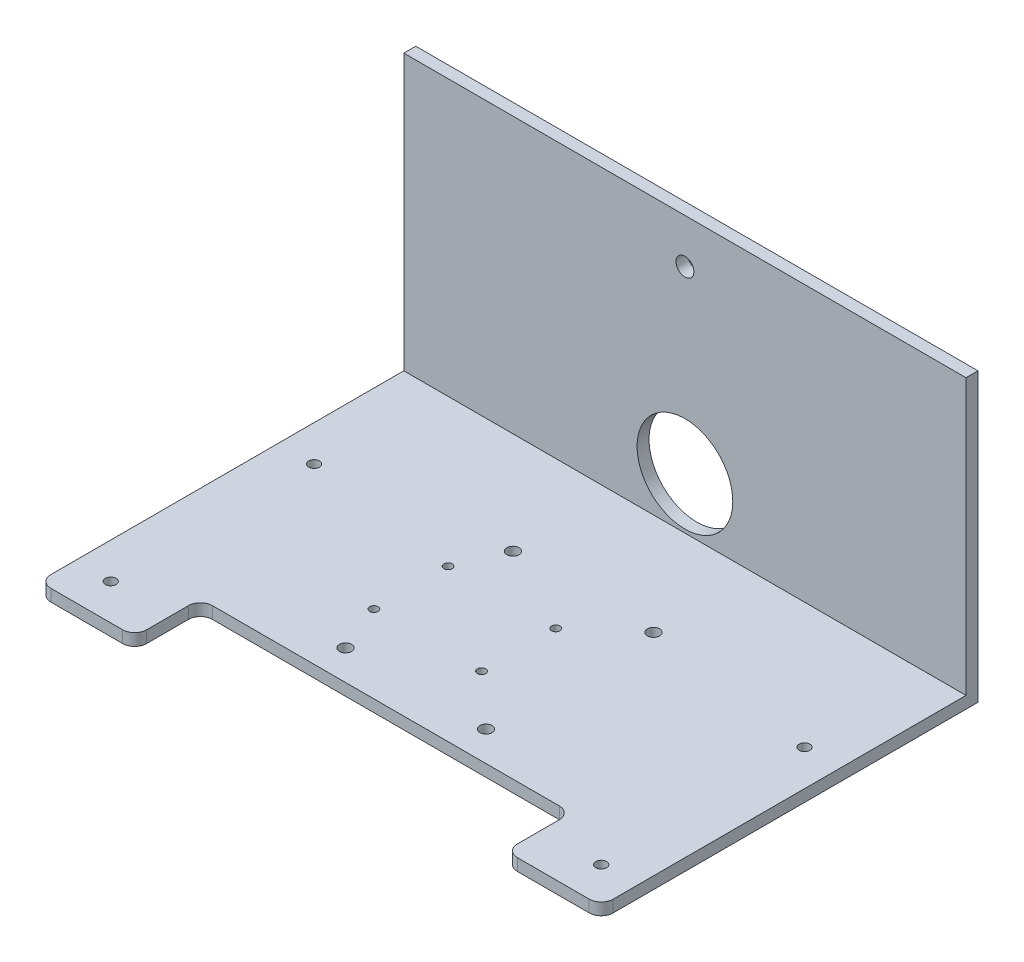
ISO-10303-21;
HEADER;
FILE_DESCRIPTION(('STEP AP214'),'2;1');
FILE_NAME('part.step','',(''),(''),'','','');
FILE_SCHEMA(('AUTOMOTIVE_DESIGN { 1 0 10303 214 1 1 1 1 }'));
ENDSEC;
DATA;
#1=APPLICATION_CONTEXT('core data for automotive mechanical design processes');
#2=APPLICATION_PROTOCOL_DEFINITION('international standard','automotive_design',2000,#1);
#3=PRODUCT_CONTEXT('',#1,'mechanical');
#4=PRODUCT('Part','Part','',(#3));
#5=PRODUCT_RELATED_PRODUCT_CATEGORY('part','',(#4));
#6=PRODUCT_DEFINITION_FORMATION('','',#4);
#7=PRODUCT_DEFINITION_CONTEXT('part definition',#1,'design');
#8=PRODUCT_DEFINITION('design','',#6,#7);
#9=PRODUCT_DEFINITION_SHAPE('','',#8);
#10=(LENGTH_UNIT() NAMED_UNIT(*) SI_UNIT(.MILLI.,.METRE.));
#11=(NAMED_UNIT(*) PLANE_ANGLE_UNIT() SI_UNIT($,.RADIAN.));
#12=(NAMED_UNIT(*) SI_UNIT($,.STERADIAN.) SOLID_ANGLE_UNIT());
#13=UNCERTAINTY_MEASURE_WITH_UNIT(LENGTH_MEASURE(1.E-05),#10,'distance_accuracy_value','');
#14=(GEOMETRIC_REPRESENTATION_CONTEXT(3) GLOBAL_UNCERTAINTY_ASSIGNED_CONTEXT((#13)) GLOBAL_UNIT_ASSIGNED_CONTEXT((#10,
#11,#12)) REPRESENTATION_CONTEXT('',''));
#15=CARTESIAN_POINT('',(0.,0.,0.));
#16=DIRECTION('',(0.,0.,1.));
#17=DIRECTION('',(1.,0.,0.));
#18=AXIS2_PLACEMENT_3D('',#15,#16,#17);
#19=CARTESIAN_POINT('',(145.,10.,-45.));
#20=DIRECTION('',(0.,1.,0.));
#21=DIRECTION('',(0.,0.,1.));
#22=AXIS2_PLACEMENT_3D('',#19,#20,#21);
#23=PLANE('',#22);
#24=DIRECTION('',(1.,0.,0.));
#25=VECTOR('',#24,1.);
#26=CARTESIAN_POINT('',(-235.,10.,-305.));
#27=LINE('',#26,#25);
#28=CARTESIAN_POINT('',(-235.,10.,-305.));
#29=VERTEX_POINT('',#28);
#30=CARTESIAN_POINT('',(235.,10.,-305.));
#31=VERTEX_POINT('',#30);
#32=EDGE_CURVE('E48',#29,#31,#27,.T.);
#33=ORIENTED_EDGE('',*,*,#32,.F.);
#34=DIRECTION('',(0.,0.,1.));
#35=VECTOR('',#34,1.);
#36=CARTESIAN_POINT('',(-235.,10.,-10.0000000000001));
#37=LINE('',#36,#35);
#38=CARTESIAN_POINT('',(-235.,10.,-10.0000000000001));
#39=VERTEX_POINT('',#38);
#40=EDGE_CURVE('E252',#29,#39,#37,.T.);
#41=ORIENTED_EDGE('',*,*,#40,.T.);
#42=CARTESIAN_POINT('',(-225.,10.,-10.));
#43=DIRECTION('',(0.,1.,0.));
#44=DIRECTION('',(0.,0.,1.));
#45=AXIS2_PLACEMENT_3D('',#42,#43,#44);
#46=CIRCLE('',#45,10.);
#47=CARTESIAN_POINT('',(-225.,10.,0.));
#48=VERTEX_POINT('',#47);
#49=EDGE_CURVE('E258',#39,#48,#46,.T.);
#50=ORIENTED_EDGE('',*,*,#49,.T.);
#51=DIRECTION('',(1.,0.,0.));
#52=VECTOR('',#51,1.);
#53=CARTESIAN_POINT('',(-165.,10.,0.));
#54=LINE('',#53,#52);
#55=CARTESIAN_POINT('',(-165.,10.,0.));
#56=VERTEX_POINT('',#55);
#57=EDGE_CURVE('E260',#48,#56,#54,.T.);
#58=ORIENTED_EDGE('',*,*,#57,.T.);
#59=CARTESIAN_POINT('',(-165.,10.,-10.));
#60=DIRECTION('',(0.,1.,0.));
#61=DIRECTION('',(0.,0.,1.));
#62=AXIS2_PLACEMENT_3D('',#59,#60,#61);
#63=CIRCLE('',#62,10.);
#64=CARTESIAN_POINT('',(-155.,10.,-10.0000000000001));
#65=VERTEX_POINT('',#64);
#66=EDGE_CURVE('E149',#56,#65,#63,.T.);
#67=ORIENTED_EDGE('',*,*,#66,.T.);
#68=DIRECTION('',(0.,0.,-1.));
#69=VECTOR('',#68,1.);
#70=CARTESIAN_POINT('',(-155.,10.,-45.));
#71=LINE('',#70,#69);
#72=CARTESIAN_POINT('',(-155.,10.,-45.));
#73=VERTEX_POINT('',#72);
#74=EDGE_CURVE('E142',#65,#73,#71,.T.);
#75=ORIENTED_EDGE('',*,*,#74,.T.);
#76=CARTESIAN_POINT('',(-145.,10.,-45.));
#77=DIRECTION('',(0.,-1.,0.));
#78=DIRECTION('',(0.,0.,-1.));
#79=AXIS2_PLACEMENT_3D('',#76,#77,#78);
#80=CIRCLE('',#79,10.);
#81=CARTESIAN_POINT('',(-145.,10.,-55.));
#82=VERTEX_POINT('',#81);
#83=EDGE_CURVE('E146',#73,#82,#80,.T.);
#84=ORIENTED_EDGE('',*,*,#83,.T.);
#85=DIRECTION('',(1.,0.,0.));
#86=VECTOR('',#85,1.);
#87=CARTESIAN_POINT('',(-145.,10.,-55.));
#88=LINE('',#87,#86);
#89=CARTESIAN_POINT('',(145.,10.,-55.));
#90=VERTEX_POINT('',#89);
#91=EDGE_CURVE('E56',#82,#90,#88,.T.);
#92=ORIENTED_EDGE('',*,*,#91,.T.);
#93=CARTESIAN_POINT('',(145.,10.,-45.));
#94=DIRECTION('',(0.,-1.,0.));
#95=DIRECTION('',(0.,0.,1.));
#96=AXIS2_PLACEMENT_3D('',#93,#94,#95);
#97=CIRCLE('',#96,10.);
#98=CARTESIAN_POINT('',(155.,10.,-45.));
#99=VERTEX_POINT('',#98);
#100=EDGE_CURVE('E198',#90,#99,#97,.T.);
#101=ORIENTED_EDGE('',*,*,#100,.T.);
#102=DIRECTION('',(0.,0.,1.));
#103=VECTOR('',#102,1.);
#104=CARTESIAN_POINT('',(155.,10.,-45.));
#105=LINE('',#104,#103);
#106=CARTESIAN_POINT('',(155.,10.,-10.0000000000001));
#107=VERTEX_POINT('',#106);
#108=EDGE_CURVE('E115',#99,#107,#105,.T.);
#109=ORIENTED_EDGE('',*,*,#108,.T.);
#110=CARTESIAN_POINT('',(165.,10.,-10.));
#111=DIRECTION('',(0.,1.,0.));
#112=DIRECTION('',(0.,0.,-1.));
#113=AXIS2_PLACEMENT_3D('',#110,#111,#112);
#114=CIRCLE('',#113,10.);
#115=CARTESIAN_POINT('',(165.,10.,0.));
#116=VERTEX_POINT('',#115);
#117=EDGE_CURVE('E231',#107,#116,#114,.T.);
#118=ORIENTED_EDGE('',*,*,#117,.T.);
#119=DIRECTION('',(1.,0.,0.));
#120=VECTOR('',#119,1.);
#121=CARTESIAN_POINT('',(165.,10.,0.));
#122=LINE('',#121,#120);
#123=CARTESIAN_POINT('',(225.,10.,0.));
#124=VERTEX_POINT('',#123);
#125=EDGE_CURVE('E250',#116,#124,#122,.T.);
#126=ORIENTED_EDGE('',*,*,#125,.T.);
#127=CARTESIAN_POINT('',(225.,10.,-10.));
#128=DIRECTION('',(0.,1.,0.));
#129=DIRECTION('',(0.,0.,-1.));
#130=AXIS2_PLACEMENT_3D('',#127,#128,#129);
#131=CIRCLE('',#130,10.);
#132=CARTESIAN_POINT('',(235.,10.,-10.0000000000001));
#133=VERTEX_POINT('',#132);
#134=EDGE_CURVE('E247',#124,#133,#131,.T.);
#135=ORIENTED_EDGE('',*,*,#134,.T.);
#136=DIRECTION('',(0.,0.,-1.));
#137=VECTOR('',#136,1.);
#138=CARTESIAN_POINT('',(235.,10.,-10.0000000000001));
#139=LINE('',#138,#137);
#140=EDGE_CURVE('E249',#133,#31,#139,.T.);
#141=ORIENTED_EDGE('',*,*,#140,.T.);
#142=EDGE_LOOP('',(#33,#41,#50,#58,#67,#75,#84,#92,#101,#109,#118,#126,#135,#141));
#143=FACE_BOUND('',#142,.T.);
#144=CARTESIAN_POINT('',(58.75,10.,-80.));
#145=DIRECTION('',(0.,1.,0.));
#146=DIRECTION('',(0.,0.,1.));
#147=AXIS2_PLACEMENT_3D('',#144,#145,#146);
#148=CIRCLE('',#147,5.12500000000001);
#149=CARTESIAN_POINT('',(58.75,10.,-74.875));
#150=VERTEX_POINT('',#149);
#151=EDGE_CURVE('E345',#150,#150,#148,.T.);
#152=ORIENTED_EDGE('',*,*,#151,.F.);
#153=EDGE_LOOP('',(#152));
#154=FACE_BOUND('',#153,.T.);
#155=CARTESIAN_POINT('',(-58.75,10.,-220.));
#156=DIRECTION('',(0.,1.,0.));
#157=DIRECTION('',(0.,0.,1.));
#158=AXIS2_PLACEMENT_3D('',#155,#156,#157);
#159=CIRCLE('',#158,5.12500000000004);
#160=CARTESIAN_POINT('',(-58.75,10.,-214.875));
#161=VERTEX_POINT('',#160);
#162=EDGE_CURVE('E339',#161,#161,#159,.T.);
#163=ORIENTED_EDGE('',*,*,#162,.F.);
#164=EDGE_LOOP('',(#163));
#165=FACE_BOUND('',#164,.T.);
#166=CARTESIAN_POINT('',(58.75,10.,-220.));
#167=DIRECTION('',(0.,1.,0.));
#168=DIRECTION('',(0.,0.,1.));
#169=AXIS2_PLACEMENT_3D('',#166,#167,#168);
#170=CIRCLE('',#169,5.12499999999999);
#171=CARTESIAN_POINT('',(58.75,10.,-214.875));
#172=VERTEX_POINT('',#171);
#173=EDGE_CURVE('E332',#172,#172,#170,.T.);
#174=ORIENTED_EDGE('',*,*,#173,.F.);
#175=EDGE_LOOP('',(#174));
#176=FACE_BOUND('',#175,.T.);
#177=CARTESIAN_POINT('',(-58.75,10.,-80.));
#178=DIRECTION('',(0.,1.,0.));
#179=DIRECTION('',(0.,0.,1.));
#180=AXIS2_PLACEMENT_3D('',#177,#178,#179);
#181=CIRCLE('',#180,5.12500000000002);
#182=CARTESIAN_POINT('',(-58.75,10.,-74.875));
#183=VERTEX_POINT('',#182);
#184=EDGE_CURVE('E326',#183,#183,#181,.T.);
#185=ORIENTED_EDGE('',*,*,#184,.F.);
#186=EDGE_LOOP('',(#185));
#187=FACE_BOUND('',#186,.T.);
#188=CARTESIAN_POINT('',(15.,10.,-182.));
#189=DIRECTION('',(0.,1.,0.));
#190=DIRECTION('',(0.,0.,1.));
#191=AXIS2_PLACEMENT_3D('',#188,#189,#190);
#192=CIRCLE('',#191,3.5);
#193=CARTESIAN_POINT('',(15.,10.,-178.5));
#194=VERTEX_POINT('',#193);
#195=EDGE_CURVE('E311',#194,#194,#192,.T.);
#196=ORIENTED_EDGE('',*,*,#195,.F.);
#197=EDGE_LOOP('',(#196));
#198=FACE_BOUND('',#197,.T.);
#199=CARTESIAN_POINT('',(-75.,10.,-182.));
#200=DIRECTION('',(0.,1.,0.));
#201=DIRECTION('',(0.,0.,1.));
#202=AXIS2_PLACEMENT_3D('',#199,#200,#201);
#203=CIRCLE('',#202,3.50000000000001);
#204=CARTESIAN_POINT('',(-75.,10.,-178.5));
#205=VERTEX_POINT('',#204);
#206=EDGE_CURVE('E299',#205,#205,#203,.T.);
#207=ORIENTED_EDGE('',*,*,#206,.F.);
#208=EDGE_LOOP('',(#207));
#209=FACE_BOUND('',#208,.T.);
#210=CARTESIAN_POINT('',(-205.,10.,-30.));
#211=DIRECTION('',(0.,1.,0.));
#212=DIRECTION('',(0.,0.,-1.));
#213=AXIS2_PLACEMENT_3D('',#210,#211,#212);
#214=CIRCLE('',#213,4.49999999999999);
#215=CARTESIAN_POINT('',(-205.,10.,-34.5));
#216=VERTEX_POINT('',#215);
#217=EDGE_CURVE('E287',#216,#216,#214,.T.);
#218=ORIENTED_EDGE('',*,*,#217,.F.);
#219=EDGE_LOOP('',(#218));
#220=FACE_BOUND('',#219,.T.);
#221=CARTESIAN_POINT('',(205.,10.,-200.));
#222=DIRECTION('',(0.,1.,0.));
#223=DIRECTION('',(0.,0.,1.));
#224=AXIS2_PLACEMENT_3D('',#221,#222,#223);
#225=CIRCLE('',#224,4.49999999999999);
#226=CARTESIAN_POINT('',(205.,10.,-195.5));
#227=VERTEX_POINT('',#226);
#228=EDGE_CURVE('E174',#227,#227,#225,.T.);
#229=ORIENTED_EDGE('',*,*,#228,.F.);
#230=EDGE_LOOP('',(#229));
#231=FACE_BOUND('',#230,.T.);
#232=CARTESIAN_POINT('',(205.,10.,-30.));
#233=DIRECTION('',(0.,1.,0.));
#234=DIRECTION('',(0.,0.,1.));
#235=AXIS2_PLACEMENT_3D('',#232,#233,#234);
#236=CIRCLE('',#235,4.49999999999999);
#237=CARTESIAN_POINT('',(205.,10.,-25.5));
#238=VERTEX_POINT('',#237);
#239=EDGE_CURVE('E281',#238,#238,#236,.T.);
#240=ORIENTED_EDGE('',*,*,#239,.F.);
#241=EDGE_LOOP('',(#240));
#242=FACE_BOUND('',#241,.T.);
#243=CARTESIAN_POINT('',(-205.,10.,-200.));
#244=DIRECTION('',(0.,1.,0.));
#245=DIRECTION('',(0.,0.,-1.));
#246=AXIS2_PLACEMENT_3D('',#243,#244,#245);
#247=CIRCLE('',#246,4.49999999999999);
#248=CARTESIAN_POINT('',(-205.,10.,-204.5));
#249=VERTEX_POINT('',#248);
#250=EDGE_CURVE('E293',#249,#249,#247,.T.);
#251=ORIENTED_EDGE('',*,*,#250,.F.);
#252=EDGE_LOOP('',(#251));
#253=FACE_BOUND('',#252,.T.);
#254=CARTESIAN_POINT('',(-75.,10.,-120.));
#255=DIRECTION('',(0.,1.,0.));
#256=DIRECTION('',(0.,0.,1.));
#257=AXIS2_PLACEMENT_3D('',#254,#255,#256);
#258=CIRCLE('',#257,3.50000000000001);
#259=CARTESIAN_POINT('',(-75.,10.,-116.5));
#260=VERTEX_POINT('',#259);
#261=EDGE_CURVE('E305',#260,#260,#258,.T.);
#262=ORIENTED_EDGE('',*,*,#261,.F.);
#263=EDGE_LOOP('',(#262));
#264=FACE_BOUND('',#263,.T.);
#265=CARTESIAN_POINT('',(15.,10.,-120.));
#266=DIRECTION('',(0.,1.,0.));
#267=DIRECTION('',(0.,0.,1.));
#268=AXIS2_PLACEMENT_3D('',#265,#266,#267);
#269=CIRCLE('',#268,3.5);
#270=CARTESIAN_POINT('',(15.,10.,-116.5));
#271=VERTEX_POINT('',#270);
#272=EDGE_CURVE('E317',#271,#271,#269,.T.);
#273=ORIENTED_EDGE('',*,*,#272,.F.);
#274=EDGE_LOOP('',(#273));
#275=FACE_BOUND('',#274,.T.);
#276=ADVANCED_FACE('F33',(#143,#154,#165,#176,#187,#198,#209,#220,#231,#242,#253,#264,#275),#23,.T.);
#277=CARTESIAN_POINT('',(145.,0.,-45.));
#278=DIRECTION('',(0.,1.,0.));
#279=DIRECTION('',(0.,0.,1.));
#280=AXIS2_PLACEMENT_3D('',#277,#278,#279);
#281=PLANE('',#280);
#282=CARTESIAN_POINT('',(58.75,0.,-80.));
#283=DIRECTION('',(0.,1.,0.));
#284=DIRECTION('',(0.,0.,1.));
#285=AXIS2_PLACEMENT_3D('',#282,#283,#284);
#286=CIRCLE('',#285,5.12500000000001);
#287=CARTESIAN_POINT('',(58.75,0.,-74.875));
#288=VERTEX_POINT('',#287);
#289=EDGE_CURVE('E329',#288,#288,#286,.T.);
#290=ORIENTED_EDGE('',*,*,#289,.T.);
#291=EDGE_LOOP('',(#290));
#292=FACE_BOUND('',#291,.T.);
#293=CARTESIAN_POINT('',(-58.75,0.,-220.));
#294=DIRECTION('',(0.,1.,0.));
#295=DIRECTION('',(0.,0.,1.));
#296=AXIS2_PLACEMENT_3D('',#293,#294,#295);
#297=CIRCLE('',#296,5.12500000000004);
#298=CARTESIAN_POINT('',(-58.75,0.,-214.875));
#299=VERTEX_POINT('',#298);
#300=EDGE_CURVE('E342',#299,#299,#297,.T.);
#301=ORIENTED_EDGE('',*,*,#300,.T.);
#302=EDGE_LOOP('',(#301));
#303=FACE_BOUND('',#302,.T.);
#304=CARTESIAN_POINT('',(58.75,0.,-220.));
#305=DIRECTION('',(0.,1.,0.));
#306=DIRECTION('',(0.,0.,1.));
#307=AXIS2_PLACEMENT_3D('',#304,#305,#306);
#308=CIRCLE('',#307,5.12499999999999);
#309=CARTESIAN_POINT('',(58.75,0.,-214.875));
#310=VERTEX_POINT('',#309);
#311=EDGE_CURVE('E335',#310,#310,#308,.T.);
#312=ORIENTED_EDGE('',*,*,#311,.T.);
#313=EDGE_LOOP('',(#312));
#314=FACE_BOUND('',#313,.T.);
#315=CARTESIAN_POINT('',(-58.75,0.,-80.));
#316=DIRECTION('',(0.,1.,0.));
#317=DIRECTION('',(0.,0.,1.));
#318=AXIS2_PLACEMENT_3D('',#315,#316,#317);
#319=CIRCLE('',#318,5.12500000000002);
#320=CARTESIAN_POINT('',(-58.75,0.,-74.875));
#321=VERTEX_POINT('',#320);
#322=EDGE_CURVE('E323',#321,#321,#319,.T.);
#323=ORIENTED_EDGE('',*,*,#322,.T.);
#324=EDGE_LOOP('',(#323));
#325=FACE_BOUND('',#324,.T.);
#326=CARTESIAN_POINT('',(145.,0.,-45.));
#327=DIRECTION('',(0.,-1.,0.));
#328=DIRECTION('',(0.,0.,1.));
#329=AXIS2_PLACEMENT_3D('',#326,#327,#328);
#330=CIRCLE('',#329,10.);
#331=CARTESIAN_POINT('',(145.,0.,-55.));
#332=VERTEX_POINT('',#331);
#333=CARTESIAN_POINT('',(155.,0.,-45.));
#334=VERTEX_POINT('',#333);
#335=EDGE_CURVE('E170',#332,#334,#330,.T.);
#336=ORIENTED_EDGE('',*,*,#335,.F.);
#337=DIRECTION('',(1.,0.,0.));
#338=VECTOR('',#337,1.);
#339=CARTESIAN_POINT('',(-145.,0.,-55.));
#340=LINE('',#339,#338);
#341=CARTESIAN_POINT('',(-145.,0.,-55.));
#342=VERTEX_POINT('',#341);
#343=EDGE_CURVE('E107',#342,#332,#340,.T.);
#344=ORIENTED_EDGE('',*,*,#343,.F.);
#345=CARTESIAN_POINT('',(-145.,0.,-45.));
#346=DIRECTION('',(0.,-1.,0.));
#347=DIRECTION('',(0.,0.,-1.));
#348=AXIS2_PLACEMENT_3D('',#345,#346,#347);
#349=CIRCLE('',#348,10.);
#350=CARTESIAN_POINT('',(-155.,0.,-45.));
#351=VERTEX_POINT('',#350);
#352=EDGE_CURVE('E195',#351,#342,#349,.T.);
#353=ORIENTED_EDGE('',*,*,#352,.F.);
#354=DIRECTION('',(0.,0.,-1.));
#355=VECTOR('',#354,1.);
#356=CARTESIAN_POINT('',(-155.,0.,-45.));
#357=LINE('',#356,#355);
#358=CARTESIAN_POINT('',(-155.,0.,-10.0000000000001));
#359=VERTEX_POINT('',#358);
#360=EDGE_CURVE('E158',#359,#351,#357,.T.);
#361=ORIENTED_EDGE('',*,*,#360,.F.);
#362=CARTESIAN_POINT('',(-165.,0.,-10.));
#363=DIRECTION('',(0.,1.,0.));
#364=DIRECTION('',(0.,0.,1.));
#365=AXIS2_PLACEMENT_3D('',#362,#363,#364);
#366=CIRCLE('',#365,10.);
#367=CARTESIAN_POINT('',(-165.,0.,0.));
#368=VERTEX_POINT('',#367);
#369=EDGE_CURVE('E192',#368,#359,#366,.T.);
#370=ORIENTED_EDGE('',*,*,#369,.F.);
#371=DIRECTION('',(1.,0.,0.));
#372=VECTOR('',#371,1.);
#373=CARTESIAN_POINT('',(-165.,0.,0.));
#374=LINE('',#373,#372);
#375=CARTESIAN_POINT('',(-225.,0.,0.));
#376=VERTEX_POINT('',#375);
#377=EDGE_CURVE('E190',#376,#368,#374,.T.);
#378=ORIENTED_EDGE('',*,*,#377,.F.);
#379=CARTESIAN_POINT('',(-225.,0.,-10.));
#380=DIRECTION('',(0.,1.,0.));
#381=DIRECTION('',(0.,0.,1.));
#382=AXIS2_PLACEMENT_3D('',#379,#380,#381);
#383=CIRCLE('',#382,10.);
#384=CARTESIAN_POINT('',(-235.,0.,-10.0000000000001));
#385=VERTEX_POINT('',#384);
#386=EDGE_CURVE('E188',#385,#376,#383,.T.);
#387=ORIENTED_EDGE('',*,*,#386,.F.);
#388=DIRECTION('',(0.,0.,1.));
#389=VECTOR('',#388,1.);
#390=CARTESIAN_POINT('',(-235.,0.,-10.0000000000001));
#391=LINE('',#390,#389);
#392=CARTESIAN_POINT('',(-235.,0.,-315.));
#393=VERTEX_POINT('',#392);
#394=EDGE_CURVE('E186',#393,#385,#391,.T.);
#395=ORIENTED_EDGE('',*,*,#394,.F.);
#396=DIRECTION('',(-1.,0.,0.));
#397=VECTOR('',#396,1.);
#398=CARTESIAN_POINT('',(-235.,0.,-315.));
#399=LINE('',#398,#397);
#400=CARTESIAN_POINT('',(235.,0.,-315.));
#401=VERTEX_POINT('',#400);
#402=EDGE_CURVE('E184',#401,#393,#399,.T.);
#403=ORIENTED_EDGE('',*,*,#402,.F.);
#404=DIRECTION('',(0.,0.,-1.));
#405=VECTOR('',#404,1.);
#406=CARTESIAN_POINT('',(235.,0.,-10.0000000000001));
#407=LINE('',#406,#405);
#408=CARTESIAN_POINT('',(235.,0.,-10.0000000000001));
#409=VERTEX_POINT('',#408);
#410=EDGE_CURVE('E182',#409,#401,#407,.T.);
#411=ORIENTED_EDGE('',*,*,#410,.F.);
#412=CARTESIAN_POINT('',(225.,0.,-10.));
#413=DIRECTION('',(0.,1.,0.));
#414=DIRECTION('',(0.,0.,-1.));
#415=AXIS2_PLACEMENT_3D('',#412,#413,#414);
#416=CIRCLE('',#415,10.);
#417=CARTESIAN_POINT('',(225.,0.,0.));
#418=VERTEX_POINT('',#417);
#419=EDGE_CURVE('E180',#418,#409,#416,.T.);
#420=ORIENTED_EDGE('',*,*,#419,.F.);
#421=DIRECTION('',(1.,0.,0.));
#422=VECTOR('',#421,1.);
#423=CARTESIAN_POINT('',(165.,0.,0.));
#424=LINE('',#423,#422);
#425=CARTESIAN_POINT('',(165.,0.,0.));
#426=VERTEX_POINT('',#425);
#427=EDGE_CURVE('E178',#426,#418,#424,.T.);
#428=ORIENTED_EDGE('',*,*,#427,.F.);
#429=CARTESIAN_POINT('',(165.,0.,-10.));
#430=DIRECTION('',(0.,1.,0.));
#431=DIRECTION('',(0.,0.,-1.));
#432=AXIS2_PLACEMENT_3D('',#429,#430,#431);
#433=CIRCLE('',#432,10.);
#434=CARTESIAN_POINT('',(155.,0.,-10.0000000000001));
#435=VERTEX_POINT('',#434);
#436=EDGE_CURVE('E176',#435,#426,#433,.T.);
#437=ORIENTED_EDGE('',*,*,#436,.F.);
#438=DIRECTION('',(0.,0.,1.));
#439=VECTOR('',#438,1.);
#440=CARTESIAN_POINT('',(155.,0.,-45.));
#441=LINE('',#440,#439);
#442=EDGE_CURVE('E173',#334,#435,#441,.T.);
#443=ORIENTED_EDGE('',*,*,#442,.F.);
#444=EDGE_LOOP('',(#336,#344,#353,#361,#370,#378,#387,#395,#403,#411,#420,#428,#437,#443));
#445=FACE_BOUND('',#444,.T.);
#446=CARTESIAN_POINT('',(205.,0.,-200.));
#447=DIRECTION('',(0.,1.,0.));
#448=DIRECTION('',(0.,0.,1.));
#449=AXIS2_PLACEMENT_3D('',#446,#447,#448);
#450=CIRCLE('',#449,4.49999999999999);
#451=CARTESIAN_POINT('',(205.,0.,-195.5));
#452=VERTEX_POINT('',#451);
#453=EDGE_CURVE('E278',#452,#452,#450,.T.);
#454=ORIENTED_EDGE('',*,*,#453,.T.);
#455=EDGE_LOOP('',(#454));
#456=FACE_BOUND('',#455,.T.);
#457=CARTESIAN_POINT('',(205.,0.,-30.));
#458=DIRECTION('',(0.,1.,0.));
#459=DIRECTION('',(0.,0.,1.));
#460=AXIS2_PLACEMENT_3D('',#457,#458,#459);
#461=CIRCLE('',#460,4.49999999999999);
#462=CARTESIAN_POINT('',(205.,0.,-25.5));
#463=VERTEX_POINT('',#462);
#464=EDGE_CURVE('E284',#463,#463,#461,.T.);
#465=ORIENTED_EDGE('',*,*,#464,.T.);
#466=EDGE_LOOP('',(#465));
#467=FACE_BOUND('',#466,.T.);
#468=CARTESIAN_POINT('',(-205.,0.,-30.));
#469=DIRECTION('',(0.,1.,0.));
#470=DIRECTION('',(0.,0.,-1.));
#471=AXIS2_PLACEMENT_3D('',#468,#469,#470);
#472=CIRCLE('',#471,4.49999999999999);
#473=CARTESIAN_POINT('',(-205.,0.,-34.5));
#474=VERTEX_POINT('',#473);
#475=EDGE_CURVE('E290',#474,#474,#472,.T.);
#476=ORIENTED_EDGE('',*,*,#475,.T.);
#477=EDGE_LOOP('',(#476));
#478=FACE_BOUND('',#477,.T.);
#479=CARTESIAN_POINT('',(-205.,0.,-200.));
#480=DIRECTION('',(0.,1.,0.));
#481=DIRECTION('',(0.,0.,-1.));
#482=AXIS2_PLACEMENT_3D('',#479,#480,#481);
#483=CIRCLE('',#482,4.49999999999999);
#484=CARTESIAN_POINT('',(-205.,0.,-204.5));
#485=VERTEX_POINT('',#484);
#486=EDGE_CURVE('E296',#485,#485,#483,.T.);
#487=ORIENTED_EDGE('',*,*,#486,.T.);
#488=EDGE_LOOP('',(#487));
#489=FACE_BOUND('',#488,.T.);
#490=CARTESIAN_POINT('',(-75.,0.,-182.));
#491=DIRECTION('',(0.,1.,0.));
#492=DIRECTION('',(0.,0.,1.));
#493=AXIS2_PLACEMENT_3D('',#490,#491,#492);
#494=CIRCLE('',#493,3.50000000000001);
#495=CARTESIAN_POINT('',(-75.,0.,-178.5));
#496=VERTEX_POINT('',#495);
#497=EDGE_CURVE('E302',#496,#496,#494,.T.);
#498=ORIENTED_EDGE('',*,*,#497,.T.);
#499=EDGE_LOOP('',(#498));
#500=FACE_BOUND('',#499,.T.);
#501=CARTESIAN_POINT('',(-75.,0.,-120.));
#502=DIRECTION('',(0.,1.,0.));
#503=DIRECTION('',(0.,0.,1.));
#504=AXIS2_PLACEMENT_3D('',#501,#502,#503);
#505=CIRCLE('',#504,3.50000000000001);
#506=CARTESIAN_POINT('',(-75.,0.,-116.5));
#507=VERTEX_POINT('',#506);
#508=EDGE_CURVE('E308',#507,#507,#505,.T.);
#509=ORIENTED_EDGE('',*,*,#508,.T.);
#510=EDGE_LOOP('',(#509));
#511=FACE_BOUND('',#510,.T.);
#512=CARTESIAN_POINT('',(15.,0.,-182.));
#513=DIRECTION('',(0.,1.,0.));
#514=DIRECTION('',(0.,0.,1.));
#515=AXIS2_PLACEMENT_3D('',#512,#513,#514);
#516=CIRCLE('',#515,3.5);
#517=CARTESIAN_POINT('',(15.,0.,-178.5));
#518=VERTEX_POINT('',#517);
#519=EDGE_CURVE('E314',#518,#518,#516,.T.);
#520=ORIENTED_EDGE('',*,*,#519,.T.);
#521=EDGE_LOOP('',(#520));
#522=FACE_BOUND('',#521,.T.);
#523=CARTESIAN_POINT('',(15.,0.,-120.));
#524=DIRECTION('',(0.,1.,0.));
#525=DIRECTION('',(0.,0.,1.));
#526=AXIS2_PLACEMENT_3D('',#523,#524,#525);
#527=CIRCLE('',#526,3.5);
#528=CARTESIAN_POINT('',(15.,0.,-116.5));
#529=VERTEX_POINT('',#528);
#530=EDGE_CURVE('E320',#529,#529,#527,.T.);
#531=ORIENTED_EDGE('',*,*,#530,.T.);
#532=EDGE_LOOP('',(#531));
#533=FACE_BOUND('',#532,.T.);
#534=ADVANCED_FACE('F235',(#292,#303,#314,#325,#445,#456,#467,#478,#489,#500,#511,#522,#533),
#281,.F.);
#535=CARTESIAN_POINT('',(145.,10.,-45.));
#536=DIRECTION('',(0.,-1.,0.));
#537=DIRECTION('',(0.,0.,-1.));
#538=AXIS2_PLACEMENT_3D('',#535,#536,#537);
#539=CYLINDRICAL_SURFACE('',#538,10.);
#540=ORIENTED_EDGE('',*,*,#335,.T.);
#541=DIRECTION('',(0.,-1.,0.));
#542=VECTOR('',#541,1.);
#543=CARTESIAN_POINT('',(155.,10.,-45.));
#544=LINE('',#543,#542);
#545=EDGE_CURVE('E11',#99,#334,#544,.T.);
#546=ORIENTED_EDGE('',*,*,#545,.F.);
#547=ORIENTED_EDGE('',*,*,#100,.F.);
#548=DIRECTION('',(0.,-1.,0.));
#549=VECTOR('',#548,1.);
#550=CARTESIAN_POINT('',(145.,10.,-55.));
#551=LINE('',#550,#549);
#552=EDGE_CURVE('E166',#90,#332,#551,.T.);
#553=ORIENTED_EDGE('',*,*,#552,.T.);
#554=EDGE_LOOP('',(#540,#546,#547,#553));
#555=FACE_BOUND('',#554,.T.);
#556=ADVANCED_FACE('F35',(#555),#539,.F.);
#557=CARTESIAN_POINT('',(155.,10.,-45.));
#558=DIRECTION('',(1.,0.,0.));
#559=DIRECTION('',(0.,0.,-1.));
#560=AXIS2_PLACEMENT_3D('',#557,#558,#559);
#561=PLANE('',#560);
#562=ORIENTED_EDGE('',*,*,#442,.T.);
#563=DIRECTION('',(0.,-1.,0.));
#564=VECTOR('',#563,1.);
#565=CARTESIAN_POINT('',(155.,10.,-10.0000000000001));
#566=LINE('',#565,#564);
#567=EDGE_CURVE('E41',#107,#435,#566,.T.);
#568=ORIENTED_EDGE('',*,*,#567,.F.);
#569=ORIENTED_EDGE('',*,*,#108,.F.);
#570=ORIENTED_EDGE('',*,*,#545,.T.);
#571=EDGE_LOOP('',(#562,#568,#569,#570));
#572=FACE_BOUND('',#571,.T.);
#573=ADVANCED_FACE('F678',(#572),#561,.F.);
#574=CARTESIAN_POINT('',(165.,10.,-10.));
#575=DIRECTION('',(0.,-1.,0.));
#576=DIRECTION('',(0.,0.,-1.));
#577=AXIS2_PLACEMENT_3D('',#574,#575,#576);
#578=CYLINDRICAL_SURFACE('',#577,10.);
#579=ORIENTED_EDGE('',*,*,#436,.T.);
#580=DIRECTION('',(0.,-1.,0.));
#581=VECTOR('',#580,1.);
#582=CARTESIAN_POINT('',(165.,10.,0.));
#583=LINE('',#582,#581);
#584=EDGE_CURVE('E223',#116,#426,#583,.T.);
#585=ORIENTED_EDGE('',*,*,#584,.F.);
#586=ORIENTED_EDGE('',*,*,#117,.F.);
#587=ORIENTED_EDGE('',*,*,#567,.T.);
#588=EDGE_LOOP('',(#579,#585,#586,#587));
#589=FACE_BOUND('',#588,.T.);
#590=ADVANCED_FACE('F229',(#589),#578,.T.);
#591=CARTESIAN_POINT('',(165.,10.,0.));
#592=DIRECTION('',(0.,0.,-1.));
#593=DIRECTION('',(-1.,0.,0.));
#594=AXIS2_PLACEMENT_3D('',#591,#592,#593);
#595=PLANE('',#594);
#596=ORIENTED_EDGE('',*,*,#427,.T.);
#597=DIRECTION('',(0.,-1.,0.));
#598=VECTOR('',#597,1.);
#599=CARTESIAN_POINT('',(225.,10.,0.));
#600=LINE('',#599,#598);
#601=EDGE_CURVE('E220',#124,#418,#600,.T.);
#602=ORIENTED_EDGE('',*,*,#601,.F.);
#603=ORIENTED_EDGE('',*,*,#125,.F.);
#604=ORIENTED_EDGE('',*,*,#584,.T.);
#605=EDGE_LOOP('',(#596,#602,#603,#604));
#606=FACE_BOUND('',#605,.T.);
#607=ADVANCED_FACE('F241',(#606),#595,.F.);
#608=CARTESIAN_POINT('',(225.,10.,-10.));
#609=DIRECTION('',(0.,-1.,0.));
#610=DIRECTION('',(0.,0.,-1.));
#611=AXIS2_PLACEMENT_3D('',#608,#609,#610);
#612=CYLINDRICAL_SURFACE('',#611,10.);
#613=ORIENTED_EDGE('',*,*,#419,.T.);
#614=DIRECTION('',(0.,-1.,0.));
#615=VECTOR('',#614,1.);
#616=CARTESIAN_POINT('',(235.,10.,-10.0000000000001));
#617=LINE('',#616,#615);
#618=EDGE_CURVE('E217',#133,#409,#617,.T.);
#619=ORIENTED_EDGE('',*,*,#618,.F.);
#620=ORIENTED_EDGE('',*,*,#134,.F.);
#621=ORIENTED_EDGE('',*,*,#601,.T.);
#622=EDGE_LOOP('',(#613,#619,#620,#621));
#623=FACE_BOUND('',#622,.T.);
#624=ADVANCED_FACE('F245',(#623),#612,.T.);
#625=CARTESIAN_POINT('',(235.,10.,-10.0000000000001));
#626=DIRECTION('',(-1.,0.,0.));
#627=DIRECTION('',(0.,0.,1.));
#628=AXIS2_PLACEMENT_3D('',#625,#626,#627);
#629=PLANE('',#628);
#630=ORIENTED_EDGE('',*,*,#410,.T.);
#631=DIRECTION('',(0.,-1.,0.));
#632=VECTOR('',#631,1.);
#633=CARTESIAN_POINT('',(235.,10.,-315.));
#634=LINE('',#633,#632);
#635=CARTESIAN_POINT('',(235.,240.,-315.));
#636=VERTEX_POINT('',#635);
#637=EDGE_CURVE('E214',#636,#401,#634,.T.);
#638=ORIENTED_EDGE('',*,*,#637,.F.);
#639=DIRECTION('',(0.,0.,-1.));
#640=VECTOR('',#639,1.);
#641=CARTESIAN_POINT('',(235.,240.,-315.));
#642=LINE('',#641,#640);
#643=CARTESIAN_POINT('',(235.,240.,-305.));
#644=VERTEX_POINT('',#643);
#645=EDGE_CURVE('E361',#644,#636,#642,.T.);
#646=ORIENTED_EDGE('',*,*,#645,.F.);
#647=DIRECTION('',(0.,-1.,0.));
#648=VECTOR('',#647,1.);
#649=CARTESIAN_POINT('',(235.,240.,-305.));
#650=LINE('',#649,#648);
#651=EDGE_CURVE('E352',#644,#31,#650,.T.);
#652=ORIENTED_EDGE('',*,*,#651,.T.);
#653=ORIENTED_EDGE('',*,*,#140,.F.);
#654=ORIENTED_EDGE('',*,*,#618,.T.);
#655=EDGE_LOOP('',(#630,#638,#646,#652,#653,#654));
#656=FACE_BOUND('',#655,.T.);
#657=ADVANCED_FACE('F399',(#656),#629,.F.);
#658=CARTESIAN_POINT('',(-235.,10.,-315.));
#659=DIRECTION('',(0.,0.,1.));
#660=DIRECTION('',(1.,0.,0.));
#661=AXIS2_PLACEMENT_3D('',#658,#659,#660);
#662=PLANE('',#661);
#663=CARTESIAN_POINT('',(0.,52.9,-315.));
#664=DIRECTION('',(0.,0.,1.));
#665=DIRECTION('',(1.,0.,0.));
#666=AXIS2_PLACEMENT_3D('',#663,#664,#665);
#667=CIRCLE('',#666,40.);
#668=CARTESIAN_POINT('',(40.,52.9,-315.));
#669=VERTEX_POINT('',#668);
#670=EDGE_CURVE('E374',#669,#669,#667,.T.);
#671=ORIENTED_EDGE('',*,*,#670,.T.);
#672=EDGE_LOOP('',(#671));
#673=FACE_BOUND('',#672,.T.);
#674=CARTESIAN_POINT('',(0.,202.9,-315.));
#675=DIRECTION('',(0.,0.,1.));
#676=DIRECTION('',(1.,0.,0.));
#677=AXIS2_PLACEMENT_3D('',#674,#675,#676);
#678=CIRCLE('',#677,7.5);
#679=CARTESIAN_POINT('',(7.5,202.9,-315.));
#680=VERTEX_POINT('',#679);
#681=EDGE_CURVE('E358',#680,#680,#678,.T.);
#682=ORIENTED_EDGE('',*,*,#681,.T.);
#683=EDGE_LOOP('',(#682));
#684=FACE_BOUND('',#683,.T.);
#685=ORIENTED_EDGE('',*,*,#402,.T.);
#686=DIRECTION('',(0.,-1.,0.));
#687=VECTOR('',#686,1.);
#688=CARTESIAN_POINT('',(-235.,10.,-315.));
#689=LINE('',#688,#687);
#690=CARTESIAN_POINT('',(-235.,240.,-315.));
#691=VERTEX_POINT('',#690);
#692=EDGE_CURVE('E211',#691,#393,#689,.T.);
#693=ORIENTED_EDGE('',*,*,#692,.F.);
#694=DIRECTION('',(-1.,0.,0.));
#695=VECTOR('',#694,1.);
#696=CARTESIAN_POINT('',(-235.,240.,-315.));
#697=LINE('',#696,#695);
#698=EDGE_CURVE('E355',#636,#691,#697,.T.);
#699=ORIENTED_EDGE('',*,*,#698,.F.);
#700=ORIENTED_EDGE('',*,*,#637,.T.);
#701=EDGE_LOOP('',(#685,#693,#699,#700));
#702=FACE_BOUND('',#701,.T.);
#703=ADVANCED_FACE('F409',(#673,#684,#702),#662,.F.);
#704=CARTESIAN_POINT('',(-235.,10.,-10.0000000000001));
#705=DIRECTION('',(1.,0.,0.));
#706=DIRECTION('',(0.,0.,-1.));
#707=AXIS2_PLACEMENT_3D('',#704,#705,#706);
#708=PLANE('',#707);
#709=ORIENTED_EDGE('',*,*,#394,.T.);
#710=DIRECTION('',(0.,-1.,0.));
#711=VECTOR('',#710,1.);
#712=CARTESIAN_POINT('',(-235.,10.,-10.0000000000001));
#713=LINE('',#712,#711);
#714=EDGE_CURVE('E208',#39,#385,#713,.T.);
#715=ORIENTED_EDGE('',*,*,#714,.F.);
#716=ORIENTED_EDGE('',*,*,#40,.F.);
#717=DIRECTION('',(0.,-1.,0.));
#718=VECTOR('',#717,1.);
#719=CARTESIAN_POINT('',(-235.,240.,-305.));
#720=LINE('',#719,#718);
#721=CARTESIAN_POINT('',(-235.,240.,-305.));
#722=VERTEX_POINT('',#721);
#723=EDGE_CURVE('E336',#722,#29,#720,.T.);
#724=ORIENTED_EDGE('',*,*,#723,.F.);
#725=DIRECTION('',(0.,0.,1.));
#726=VECTOR('',#725,1.);
#727=CARTESIAN_POINT('',(-235.,240.,-315.));
#728=LINE('',#727,#726);
#729=EDGE_CURVE('E357',#691,#722,#728,.T.);
#730=ORIENTED_EDGE('',*,*,#729,.F.);
#731=ORIENTED_EDGE('',*,*,#692,.T.);
#732=EDGE_LOOP('',(#709,#715,#716,#724,#730,#731));
#733=FACE_BOUND('',#732,.T.);
#734=ADVANCED_FACE('F413',(#733),#708,.F.);
#735=CARTESIAN_POINT('',(-225.,10.,-10.));
#736=DIRECTION('',(0.,-1.,0.));
#737=DIRECTION('',(0.,0.,-1.));
#738=AXIS2_PLACEMENT_3D('',#735,#736,#737);
#739=CYLINDRICAL_SURFACE('',#738,10.);
#740=ORIENTED_EDGE('',*,*,#386,.T.);
#741=DIRECTION('',(0.,-1.,0.));
#742=VECTOR('',#741,1.);
#743=CARTESIAN_POINT('',(-225.,10.,0.));
#744=LINE('',#743,#742);
#745=EDGE_CURVE('E205',#48,#376,#744,.T.);
#746=ORIENTED_EDGE('',*,*,#745,.F.);
#747=ORIENTED_EDGE('',*,*,#49,.F.);
#748=ORIENTED_EDGE('',*,*,#714,.T.);
#749=EDGE_LOOP('',(#740,#746,#747,#748));
#750=FACE_BOUND('',#749,.T.);
#751=ADVANCED_FACE('F417',(#750),#739,.T.);
#752=CARTESIAN_POINT('',(-165.,10.,0.));
#753=DIRECTION('',(0.,0.,-1.));
#754=DIRECTION('',(-1.,0.,0.));
#755=AXIS2_PLACEMENT_3D('',#752,#753,#754);
#756=PLANE('',#755);
#757=ORIENTED_EDGE('',*,*,#377,.T.);
#758=DIRECTION('',(0.,-1.,0.));
#759=VECTOR('',#758,1.);
#760=CARTESIAN_POINT('',(-165.,10.,0.));
#761=LINE('',#760,#759);
#762=EDGE_CURVE('E202',#56,#368,#761,.T.);
#763=ORIENTED_EDGE('',*,*,#762,.F.);
#764=ORIENTED_EDGE('',*,*,#57,.F.);
#765=ORIENTED_EDGE('',*,*,#745,.T.);
#766=EDGE_LOOP('',(#757,#763,#764,#765));
#767=FACE_BOUND('',#766,.T.);
#768=ADVANCED_FACE('F266',(#767),#756,.F.);
#769=CARTESIAN_POINT('',(-165.,10.,-10.));
#770=DIRECTION('',(0.,-1.,0.));
#771=DIRECTION('',(0.,0.,-1.));
#772=AXIS2_PLACEMENT_3D('',#769,#770,#771);
#773=CYLINDRICAL_SURFACE('',#772,10.);
#774=ORIENTED_EDGE('',*,*,#369,.T.);
#775=DIRECTION('',(0.,-1.,0.));
#776=VECTOR('',#775,1.);
#777=CARTESIAN_POINT('',(-155.,10.,-10.0000000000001));
#778=LINE('',#777,#776);
#779=EDGE_CURVE('E161',#65,#359,#778,.T.);
#780=ORIENTED_EDGE('',*,*,#779,.F.);
#781=ORIENTED_EDGE('',*,*,#66,.F.);
#782=ORIENTED_EDGE('',*,*,#762,.T.);
#783=EDGE_LOOP('',(#774,#780,#781,#782));
#784=FACE_BOUND('',#783,.T.);
#785=ADVANCED_FACE('F270',(#784),#773,.T.);
#786=CARTESIAN_POINT('',(-155.,10.,-45.));
#787=DIRECTION('',(-1.,0.,0.));
#788=DIRECTION('',(0.,0.,1.));
#789=AXIS2_PLACEMENT_3D('',#786,#787,#788);
#790=PLANE('',#789);
#791=ORIENTED_EDGE('',*,*,#360,.T.);
#792=DIRECTION('',(0.,-1.,0.));
#793=VECTOR('',#792,1.);
#794=CARTESIAN_POINT('',(-155.,10.,-45.));
#795=LINE('',#794,#793);
#796=EDGE_CURVE('E155',#73,#351,#795,.T.);
#797=ORIENTED_EDGE('',*,*,#796,.F.);
#798=ORIENTED_EDGE('',*,*,#74,.F.);
#799=ORIENTED_EDGE('',*,*,#779,.T.);
#800=EDGE_LOOP('',(#791,#797,#798,#799));
#801=FACE_BOUND('',#800,.T.);
#802=ADVANCED_FACE('F156',(#801),#790,.F.);
#803=CARTESIAN_POINT('',(-145.,10.,-45.));
#804=DIRECTION('',(0.,-1.,0.));
#805=DIRECTION('',(0.,0.,-1.));
#806=AXIS2_PLACEMENT_3D('',#803,#804,#805);
#807=CYLINDRICAL_SURFACE('',#806,10.);
#808=ORIENTED_EDGE('',*,*,#352,.T.);
#809=DIRECTION('',(0.,-1.,0.));
#810=VECTOR('',#809,1.);
#811=CARTESIAN_POINT('',(-145.,10.,-55.));
#812=LINE('',#811,#810);
#813=EDGE_CURVE('E162',#82,#342,#812,.T.);
#814=ORIENTED_EDGE('',*,*,#813,.F.);
#815=ORIENTED_EDGE('',*,*,#83,.F.);
#816=ORIENTED_EDGE('',*,*,#796,.T.);
#817=EDGE_LOOP('',(#808,#814,#815,#816));
#818=FACE_BOUND('',#817,.T.);
#819=ADVANCED_FACE('F164',(#818),#807,.F.);
#820=CARTESIAN_POINT('',(-145.,10.,-55.));
#821=DIRECTION('',(0.,0.,-1.));
#822=DIRECTION('',(-1.,0.,0.));
#823=AXIS2_PLACEMENT_3D('',#820,#821,#822);
#824=PLANE('',#823);
#825=ORIENTED_EDGE('',*,*,#343,.T.);
#826=ORIENTED_EDGE('',*,*,#552,.F.);
#827=ORIENTED_EDGE('',*,*,#91,.F.);
#828=ORIENTED_EDGE('',*,*,#813,.T.);
#829=EDGE_LOOP('',(#825,#826,#827,#828));
#830=FACE_BOUND('',#829,.T.);
#831=ADVANCED_FACE('F271',(#830),#824,.F.);
#832=CARTESIAN_POINT('',(205.,10.,-200.));
#833=DIRECTION('',(0.,-1.,0.));
#834=DIRECTION('',(0.,0.,-1.));
#835=AXIS2_PLACEMENT_3D('',#832,#833,#834);
#836=CYLINDRICAL_SURFACE('',#835,4.49999999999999);
#837=ORIENTED_EDGE('',*,*,#228,.T.);
#838=EDGE_LOOP('',(#837));
#839=FACE_BOUND('',#838,.T.);
#840=ORIENTED_EDGE('',*,*,#453,.F.);
#841=EDGE_LOOP('',(#840));
#842=FACE_BOUND('',#841,.T.);
#843=ADVANCED_FACE('F435',(#839,#842),#836,.F.);
#844=CARTESIAN_POINT('',(205.,10.,-30.));
#845=DIRECTION('',(0.,-1.,0.));
#846=DIRECTION('',(0.,0.,-1.));
#847=AXIS2_PLACEMENT_3D('',#844,#845,#846);
#848=CYLINDRICAL_SURFACE('',#847,4.49999999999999);
#849=ORIENTED_EDGE('',*,*,#239,.T.);
#850=EDGE_LOOP('',(#849));
#851=FACE_BOUND('',#850,.T.);
#852=ORIENTED_EDGE('',*,*,#464,.F.);
#853=EDGE_LOOP('',(#852));
#854=FACE_BOUND('',#853,.T.);
#855=ADVANCED_FACE('F467',(#851,#854),#848,.F.);
#856=CARTESIAN_POINT('',(-205.,10.,-30.));
#857=DIRECTION('',(0.,-1.,0.));
#858=DIRECTION('',(0.,0.,-1.));
#859=AXIS2_PLACEMENT_3D('',#856,#857,#858);
#860=CYLINDRICAL_SURFACE('',#859,4.49999999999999);
#861=ORIENTED_EDGE('',*,*,#217,.T.);
#862=EDGE_LOOP('',(#861));
#863=FACE_BOUND('',#862,.T.);
#864=ORIENTED_EDGE('',*,*,#475,.F.);
#865=EDGE_LOOP('',(#864));
#866=FACE_BOUND('',#865,.T.);
#867=ADVANCED_FACE('F474',(#863,#866),#860,.F.);
#868=CARTESIAN_POINT('',(-205.,10.,-200.));
#869=DIRECTION('',(0.,-1.,0.));
#870=DIRECTION('',(0.,0.,-1.));
#871=AXIS2_PLACEMENT_3D('',#868,#869,#870);
#872=CYLINDRICAL_SURFACE('',#871,4.49999999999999);
#873=ORIENTED_EDGE('',*,*,#250,.T.);
#874=EDGE_LOOP('',(#873));
#875=FACE_BOUND('',#874,.T.);
#876=ORIENTED_EDGE('',*,*,#486,.F.);
#877=EDGE_LOOP('',(#876));
#878=FACE_BOUND('',#877,.T.);
#879=ADVANCED_FACE('F481',(#875,#878),#872,.F.);
#880=CARTESIAN_POINT('',(-75.,10.,-182.));
#881=DIRECTION('',(0.,-1.,0.));
#882=DIRECTION('',(0.,0.,-1.));
#883=AXIS2_PLACEMENT_3D('',#880,#881,#882);
#884=CYLINDRICAL_SURFACE('',#883,3.50000000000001);
#885=ORIENTED_EDGE('',*,*,#206,.T.);
#886=EDGE_LOOP('',(#885));
#887=FACE_BOUND('',#886,.T.);
#888=ORIENTED_EDGE('',*,*,#497,.F.);
#889=EDGE_LOOP('',(#888));
#890=FACE_BOUND('',#889,.T.);
#891=ADVANCED_FACE('F489',(#887,#890),#884,.F.);
#892=CARTESIAN_POINT('',(-75.,10.,-120.));
#893=DIRECTION('',(0.,-1.,0.));
#894=DIRECTION('',(0.,0.,-1.));
#895=AXIS2_PLACEMENT_3D('',#892,#893,#894);
#896=CYLINDRICAL_SURFACE('',#895,3.50000000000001);
#897=ORIENTED_EDGE('',*,*,#261,.T.);
#898=EDGE_LOOP('',(#897));
#899=FACE_BOUND('',#898,.T.);
#900=ORIENTED_EDGE('',*,*,#508,.F.);
#901=EDGE_LOOP('',(#900));
#902=FACE_BOUND('',#901,.T.);
#903=ADVANCED_FACE('F497',(#899,#902),#896,.F.);
#904=CARTESIAN_POINT('',(15.,10.,-182.));
#905=DIRECTION('',(0.,-1.,0.));
#906=DIRECTION('',(0.,0.,-1.));
#907=AXIS2_PLACEMENT_3D('',#904,#905,#906);
#908=CYLINDRICAL_SURFACE('',#907,3.5);
#909=ORIENTED_EDGE('',*,*,#195,.T.);
#910=EDGE_LOOP('',(#909));
#911=FACE_BOUND('',#910,.T.);
#912=ORIENTED_EDGE('',*,*,#519,.F.);
#913=EDGE_LOOP('',(#912));
#914=FACE_BOUND('',#913,.T.);
#915=ADVANCED_FACE('F505',(#911,#914),#908,.F.);
#916=CARTESIAN_POINT('',(15.,10.,-120.));
#917=DIRECTION('',(0.,-1.,0.));
#918=DIRECTION('',(0.,0.,-1.));
#919=AXIS2_PLACEMENT_3D('',#916,#917,#918);
#920=CYLINDRICAL_SURFACE('',#919,3.5);
#921=ORIENTED_EDGE('',*,*,#272,.T.);
#922=EDGE_LOOP('',(#921));
#923=FACE_BOUND('',#922,.T.);
#924=ORIENTED_EDGE('',*,*,#530,.F.);
#925=EDGE_LOOP('',(#924));
#926=FACE_BOUND('',#925,.T.);
#927=ADVANCED_FACE('F513',(#923,#926),#920,.F.);
#928=CARTESIAN_POINT('',(-58.75,0.,-80.));
#929=DIRECTION('',(0.,1.,0.));
#930=DIRECTION('',(0.,0.,1.));
#931=AXIS2_PLACEMENT_3D('',#928,#929,#930);
#932=CYLINDRICAL_SURFACE('',#931,5.12500000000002);
#933=ORIENTED_EDGE('',*,*,#322,.F.);
#934=EDGE_LOOP('',(#933));
#935=FACE_BOUND('',#934,.T.);
#936=ORIENTED_EDGE('',*,*,#184,.T.);
#937=EDGE_LOOP('',(#936));
#938=FACE_BOUND('',#937,.T.);
#939=ADVANCED_FACE('F521',(#935,#938),#932,.F.);
#940=CARTESIAN_POINT('',(58.75,0.,-220.));
#941=DIRECTION('',(0.,1.,0.));
#942=DIRECTION('',(0.,0.,1.));
#943=AXIS2_PLACEMENT_3D('',#940,#941,#942);
#944=CYLINDRICAL_SURFACE('',#943,5.12499999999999);
#945=ORIENTED_EDGE('',*,*,#311,.F.);
#946=EDGE_LOOP('',(#945));
#947=FACE_BOUND('',#946,.T.);
#948=ORIENTED_EDGE('',*,*,#173,.T.);
#949=EDGE_LOOP('',(#948));
#950=FACE_BOUND('',#949,.T.);
#951=ADVANCED_FACE('F530',(#947,#950),#944,.F.);
#952=CARTESIAN_POINT('',(-58.75,0.,-220.));
#953=DIRECTION('',(0.,1.,0.));
#954=DIRECTION('',(0.,0.,1.));
#955=AXIS2_PLACEMENT_3D('',#952,#953,#954);
#956=CYLINDRICAL_SURFACE('',#955,5.12500000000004);
#957=ORIENTED_EDGE('',*,*,#300,.F.);
#958=EDGE_LOOP('',(#957));
#959=FACE_BOUND('',#958,.T.);
#960=ORIENTED_EDGE('',*,*,#162,.T.);
#961=EDGE_LOOP('',(#960));
#962=FACE_BOUND('',#961,.T.);
#963=ADVANCED_FACE('F538',(#959,#962),#956,.F.);
#964=CARTESIAN_POINT('',(58.75,0.,-80.));
#965=DIRECTION('',(0.,1.,0.));
#966=DIRECTION('',(0.,0.,1.));
#967=AXIS2_PLACEMENT_3D('',#964,#965,#966);
#968=CYLINDRICAL_SURFACE('',#967,5.12500000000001);
#969=ORIENTED_EDGE('',*,*,#289,.F.);
#970=EDGE_LOOP('',(#969));
#971=FACE_BOUND('',#970,.T.);
#972=ORIENTED_EDGE('',*,*,#151,.T.);
#973=EDGE_LOOP('',(#972));
#974=FACE_BOUND('',#973,.T.);
#975=ADVANCED_FACE('F388',(#971,#974),#968,.F.);
#976=CARTESIAN_POINT('',(-235.,240.,-305.));
#977=DIRECTION('',(0.,0.,-1.));
#978=DIRECTION('',(-1.,0.,0.));
#979=AXIS2_PLACEMENT_3D('',#976,#977,#978);
#980=PLANE('',#979);
#981=CARTESIAN_POINT('',(0.,52.9,-305.));
#982=DIRECTION('',(0.,0.,1.));
#983=DIRECTION('',(1.,0.,0.));
#984=AXIS2_PLACEMENT_3D('',#981,#982,#983);
#985=CIRCLE('',#984,40.);
#986=CARTESIAN_POINT('',(40.,52.9,-305.));
#987=VERTEX_POINT('',#986);
#988=EDGE_CURVE('E377',#987,#987,#985,.T.);
#989=ORIENTED_EDGE('',*,*,#988,.F.);
#990=EDGE_LOOP('',(#989));
#991=FACE_BOUND('',#990,.T.);
#992=CARTESIAN_POINT('',(0.,202.9,-305.));
#993=DIRECTION('',(0.,0.,1.));
#994=DIRECTION('',(1.,0.,0.));
#995=AXIS2_PLACEMENT_3D('',#992,#993,#994);
#996=CIRCLE('',#995,7.5);
#997=CARTESIAN_POINT('',(7.5,202.9,-305.));
#998=VERTEX_POINT('',#997);
#999=EDGE_CURVE('E371',#998,#998,#996,.T.);
#1000=ORIENTED_EDGE('',*,*,#999,.F.);
#1001=EDGE_LOOP('',(#1000));
#1002=FACE_BOUND('',#1001,.T.);
#1003=ORIENTED_EDGE('',*,*,#32,.T.);
#1004=ORIENTED_EDGE('',*,*,#651,.F.);
#1005=DIRECTION('',(1.,0.,0.));
#1006=VECTOR('',#1005,1.);
#1007=CARTESIAN_POINT('',(-235.,240.,-305.));
#1008=LINE('',#1007,#1006);
#1009=EDGE_CURVE('E364',#722,#644,#1008,.T.);
#1010=ORIENTED_EDGE('',*,*,#1009,.F.);
#1011=ORIENTED_EDGE('',*,*,#723,.T.);
#1012=EDGE_LOOP('',(#1003,#1004,#1010,#1011));
#1013=FACE_BOUND('',#1012,.T.);
#1014=ADVANCED_FACE('F384',(#991,#1002,#1013),#980,.F.);
#1015=CARTESIAN_POINT('',(0.,240.,0.));
#1016=DIRECTION('',(0.,1.,0.));
#1017=DIRECTION('',(0.,0.,1.));
#1018=AXIS2_PLACEMENT_3D('',#1015,#1016,#1017);
#1019=PLANE('',#1018);
#1020=ORIENTED_EDGE('',*,*,#729,.T.);
#1021=ORIENTED_EDGE('',*,*,#1009,.T.);
#1022=ORIENTED_EDGE('',*,*,#645,.T.);
#1023=ORIENTED_EDGE('',*,*,#698,.T.);
#1024=EDGE_LOOP('',(#1020,#1021,#1022,#1023));
#1025=FACE_BOUND('',#1024,.T.);
#1026=ADVANCED_FACE('F387',(#1025),#1019,.T.);
#1027=CARTESIAN_POINT('',(0.,202.9,-405.));
#1028=DIRECTION('',(0.,0.,1.));
#1029=DIRECTION('',(1.,0.,0.));
#1030=AXIS2_PLACEMENT_3D('',#1027,#1028,#1029);
#1031=CYLINDRICAL_SURFACE('',#1030,7.5);
#1032=CARTESIAN_POINT('',(7.5,202.9,-305.));
#1033=CARTESIAN_POINT('',(7.5,202.9,-305.104166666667));
#1034=CARTESIAN_POINT('',(7.5,202.9,-305.208333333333));
#1035=CARTESIAN_POINT('',(7.5,202.9,-305.416666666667));
#1036=CARTESIAN_POINT('',(7.5,202.9,-305.520833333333));
#1037=CARTESIAN_POINT('',(7.5,202.9,-305.729166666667));
#1038=CARTESIAN_POINT('',(7.5,202.9,-305.833333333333));
#1039=CARTESIAN_POINT('',(7.5,202.9,-306.041666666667));
#1040=CARTESIAN_POINT('',(7.5,202.9,-306.145833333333));
#1041=CARTESIAN_POINT('',(7.5,202.9,-306.354166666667));
#1042=CARTESIAN_POINT('',(7.5,202.9,-306.458333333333));
#1043=CARTESIAN_POINT('',(7.5,202.9,-306.666666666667));
#1044=CARTESIAN_POINT('',(7.5,202.9,-306.770833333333));
#1045=CARTESIAN_POINT('',(7.5,202.9,-306.979166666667));
#1046=CARTESIAN_POINT('',(7.5,202.9,-307.083333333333));
#1047=CARTESIAN_POINT('',(7.5,202.9,-307.291666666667));
#1048=CARTESIAN_POINT('',(7.5,202.9,-307.395833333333));
#1049=CARTESIAN_POINT('',(7.5,202.9,-307.604166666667));
#1050=CARTESIAN_POINT('',(7.5,202.9,-307.708333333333));
#1051=CARTESIAN_POINT('',(7.5,202.9,-307.916666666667));
#1052=CARTESIAN_POINT('',(7.5,202.9,-308.020833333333));
#1053=CARTESIAN_POINT('',(7.5,202.9,-308.229166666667));
#1054=CARTESIAN_POINT('',(7.5,202.9,-308.333333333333));
#1055=CARTESIAN_POINT('',(7.5,202.9,-308.541666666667));
#1056=CARTESIAN_POINT('',(7.5,202.9,-308.645833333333));
#1057=CARTESIAN_POINT('',(7.5,202.9,-308.854166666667));
#1058=CARTESIAN_POINT('',(7.5,202.9,-308.958333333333));
#1059=CARTESIAN_POINT('',(7.5,202.9,-309.166666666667));
#1060=CARTESIAN_POINT('',(7.5,202.9,-309.270833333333));
#1061=CARTESIAN_POINT('',(7.5,202.9,-309.479166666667));
#1062=CARTESIAN_POINT('',(7.5,202.9,-309.583333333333));
#1063=CARTESIAN_POINT('',(7.5,202.9,-309.791666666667));
#1064=CARTESIAN_POINT('',(7.5,202.9,-309.895833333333));
#1065=CARTESIAN_POINT('',(7.5,202.9,-310.104166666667));
#1066=CARTESIAN_POINT('',(7.5,202.9,-310.208333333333));
#1067=CARTESIAN_POINT('',(7.5,202.9,-310.416666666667));
#1068=CARTESIAN_POINT('',(7.5,202.9,-310.520833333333));
#1069=CARTESIAN_POINT('',(7.5,202.9,-310.729166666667));
#1070=CARTESIAN_POINT('',(7.5,202.9,-310.833333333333));
#1071=CARTESIAN_POINT('',(7.5,202.9,-311.041666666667));
#1072=CARTESIAN_POINT('',(7.5,202.9,-311.145833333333));
#1073=CARTESIAN_POINT('',(7.5,202.9,-311.354166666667));
#1074=CARTESIAN_POINT('',(7.5,202.9,-311.458333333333));
#1075=CARTESIAN_POINT('',(7.5,202.9,-311.666666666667));
#1076=CARTESIAN_POINT('',(7.5,202.9,-311.770833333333));
#1077=CARTESIAN_POINT('',(7.5,202.9,-311.979166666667));
#1078=CARTESIAN_POINT('',(7.5,202.9,-312.083333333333));
#1079=CARTESIAN_POINT('',(7.5,202.9,-312.291666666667));
#1080=CARTESIAN_POINT('',(7.5,202.9,-312.395833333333));
#1081=CARTESIAN_POINT('',(7.5,202.9,-312.604166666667));
#1082=CARTESIAN_POINT('',(7.5,202.9,-312.708333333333));
#1083=CARTESIAN_POINT('',(7.5,202.9,-312.916666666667));
#1084=CARTESIAN_POINT('',(7.5,202.9,-313.020833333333));
#1085=CARTESIAN_POINT('',(7.5,202.9,-313.229166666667));
#1086=CARTESIAN_POINT('',(7.5,202.9,-313.333333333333));
#1087=CARTESIAN_POINT('',(7.5,202.9,-313.541666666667));
#1088=CARTESIAN_POINT('',(7.5,202.9,-313.645833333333));
#1089=CARTESIAN_POINT('',(7.5,202.9,-313.854166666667));
#1090=CARTESIAN_POINT('',(7.5,202.9,-313.958333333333));
#1091=CARTESIAN_POINT('',(7.5,202.9,-314.166666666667));
#1092=CARTESIAN_POINT('',(7.5,202.9,-314.270833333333));
#1093=CARTESIAN_POINT('',(7.5,202.9,-314.479166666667));
#1094=CARTESIAN_POINT('',(7.5,202.9,-314.583333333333));
#1095=CARTESIAN_POINT('',(7.5,202.9,-314.791666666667));
#1096=CARTESIAN_POINT('',(7.5,202.9,-314.895833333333));
#1097=CARTESIAN_POINT('',(7.5,202.9,-315.));
#1098=B_SPLINE_CURVE_WITH_KNOTS('',3,(#1032,#1033,#1034,#1035,#1036,#1037,#1038,#1039,#1040,
#1041,#1042,#1043,#1044,#1045,#1046,#1047,#1048,#1049,#1050,#1051,#1052,#1053,#1054,#1055,#1056,
#1057,#1058,#1059,#1060,#1061,#1062,#1063,#1064,#1065,#1066,#1067,#1068,#1069,#1070,#1071,#1072,
#1073,#1074,#1075,#1076,#1077,#1078,#1079,#1080,#1081,#1082,#1083,#1084,#1085,#1086,#1087,#1088,
#1089,#1090,#1091,#1092,#1093,#1094,#1095,#1096,#1097),.UNSPECIFIED.,.F.,.F.,(4,2,2,2,2,2,2,2,2,
2,2,2,2,2,2,2,2,2,2,2,2,2,2,2,2,2,2,2,2,2,2,2,4),(0.,0.312499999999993,0.625000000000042,
0.937500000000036,1.25000000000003,1.56250000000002,1.87500000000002,2.18750000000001,2.5,
2.8125,3.12499999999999,3.43750000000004,3.75000000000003,4.06250000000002,4.37500000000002,
4.68750000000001,5.,5.3125,5.62500000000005,5.93750000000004,6.25000000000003,6.56250000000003,
6.87500000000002,7.18750000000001,7.50000000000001,7.8125,8.12499999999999,8.43750000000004,
8.75000000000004,9.06250000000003,9.37500000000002,9.68750000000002,10.),.UNSPECIFIED.);
#1099=EDGE_CURVE('BSEAM566',#998,#680,#1098,.T.);
#1100=ORIENTED_EDGE('',*,*,#999,.T.);
#1101=ORIENTED_EDGE('',*,*,#681,.F.);
#1102=ORIENTED_EDGE('',*,*,#1099,.T.);
#1103=ORIENTED_EDGE('',*,*,#1099,.F.);
#1104=EDGE_LOOP('',(#1100,#1102,#1101,#1103));
#1105=FACE_BOUND('',#1104,.T.);
#1106=ADVANCED_FACE('F566',(#1105),#1031,.F.);
#1107=CARTESIAN_POINT('',(0.,52.9,-405.));
#1108=DIRECTION('',(0.,0.,1.));
#1109=DIRECTION('',(1.,0.,0.));
#1110=AXIS2_PLACEMENT_3D('',#1107,#1108,#1109);
#1111=CYLINDRICAL_SURFACE('',#1110,40.);
#1112=CARTESIAN_POINT('',(40.,52.9,-305.));
#1113=CARTESIAN_POINT('',(40.,52.9,-305.104166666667));
#1114=CARTESIAN_POINT('',(40.,52.9,-305.208333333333));
#1115=CARTESIAN_POINT('',(40.,52.9,-305.416666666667));
#1116=CARTESIAN_POINT('',(40.,52.9,-305.520833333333));
#1117=CARTESIAN_POINT('',(40.,52.9,-305.729166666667));
#1118=CARTESIAN_POINT('',(40.,52.9,-305.833333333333));
#1119=CARTESIAN_POINT('',(40.,52.9,-306.041666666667));
#1120=CARTESIAN_POINT('',(40.,52.9,-306.145833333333));
#1121=CARTESIAN_POINT('',(40.,52.9,-306.354166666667));
#1122=CARTESIAN_POINT('',(40.,52.9,-306.458333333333));
#1123=CARTESIAN_POINT('',(40.,52.9,-306.666666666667));
#1124=CARTESIAN_POINT('',(40.,52.9,-306.770833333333));
#1125=CARTESIAN_POINT('',(40.,52.9,-306.979166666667));
#1126=CARTESIAN_POINT('',(40.,52.9,-307.083333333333));
#1127=CARTESIAN_POINT('',(40.,52.9,-307.291666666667));
#1128=CARTESIAN_POINT('',(40.,52.9,-307.395833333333));
#1129=CARTESIAN_POINT('',(40.,52.9,-307.604166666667));
#1130=CARTESIAN_POINT('',(40.,52.9,-307.708333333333));
#1131=CARTESIAN_POINT('',(40.,52.9,-307.916666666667));
#1132=CARTESIAN_POINT('',(40.,52.9,-308.020833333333));
#1133=CARTESIAN_POINT('',(40.,52.9,-308.229166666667));
#1134=CARTESIAN_POINT('',(40.,52.9,-308.333333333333));
#1135=CARTESIAN_POINT('',(40.,52.9,-308.541666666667));
#1136=CARTESIAN_POINT('',(40.,52.9,-308.645833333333));
#1137=CARTESIAN_POINT('',(40.,52.9,-308.854166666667));
#1138=CARTESIAN_POINT('',(40.,52.9,-308.958333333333));
#1139=CARTESIAN_POINT('',(40.,52.9,-309.166666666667));
#1140=CARTESIAN_POINT('',(40.,52.9,-309.270833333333));
#1141=CARTESIAN_POINT('',(40.,52.9,-309.479166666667));
#1142=CARTESIAN_POINT('',(40.,52.9,-309.583333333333));
#1143=CARTESIAN_POINT('',(40.,52.9,-309.791666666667));
#1144=CARTESIAN_POINT('',(40.,52.9,-309.895833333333));
#1145=CARTESIAN_POINT('',(40.,52.9,-310.104166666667));
#1146=CARTESIAN_POINT('',(40.,52.9,-310.208333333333));
#1147=CARTESIAN_POINT('',(40.,52.9,-310.416666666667));
#1148=CARTESIAN_POINT('',(40.,52.9,-310.520833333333));
#1149=CARTESIAN_POINT('',(40.,52.9,-310.729166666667));
#1150=CARTESIAN_POINT('',(40.,52.9,-310.833333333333));
#1151=CARTESIAN_POINT('',(40.,52.9,-311.041666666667));
#1152=CARTESIAN_POINT('',(40.,52.9,-311.145833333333));
#1153=CARTESIAN_POINT('',(40.,52.9,-311.354166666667));
#1154=CARTESIAN_POINT('',(40.,52.9,-311.458333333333));
#1155=CARTESIAN_POINT('',(40.,52.9,-311.666666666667));
#1156=CARTESIAN_POINT('',(40.,52.9,-311.770833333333));
#1157=CARTESIAN_POINT('',(40.,52.9,-311.979166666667));
#1158=CARTESIAN_POINT('',(40.,52.9,-312.083333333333));
#1159=CARTESIAN_POINT('',(40.,52.9,-312.291666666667));
#1160=CARTESIAN_POINT('',(40.,52.9,-312.395833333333));
#1161=CARTESIAN_POINT('',(40.,52.9,-312.604166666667));
#1162=CARTESIAN_POINT('',(40.,52.9,-312.708333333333));
#1163=CARTESIAN_POINT('',(40.,52.9,-312.916666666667));
#1164=CARTESIAN_POINT('',(40.,52.9,-313.020833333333));
#1165=CARTESIAN_POINT('',(40.,52.9,-313.229166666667));
#1166=CARTESIAN_POINT('',(40.,52.9,-313.333333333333));
#1167=CARTESIAN_POINT('',(40.,52.9,-313.541666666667));
#1168=CARTESIAN_POINT('',(40.,52.9,-313.645833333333));
#1169=CARTESIAN_POINT('',(40.,52.9,-313.854166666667));
#1170=CARTESIAN_POINT('',(40.,52.9,-313.958333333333));
#1171=CARTESIAN_POINT('',(40.,52.9,-314.166666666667));
#1172=CARTESIAN_POINT('',(40.,52.9,-314.270833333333));
#1173=CARTESIAN_POINT('',(40.,52.9,-314.479166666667));
#1174=CARTESIAN_POINT('',(40.,52.9,-314.583333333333));
#1175=CARTESIAN_POINT('',(40.,52.9,-314.791666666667));
#1176=CARTESIAN_POINT('',(40.,52.9,-314.895833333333));
#1177=CARTESIAN_POINT('',(40.,52.9,-315.));
#1178=B_SPLINE_CURVE_WITH_KNOTS('',3,(#1112,#1113,#1114,#1115,#1116,#1117,#1118,#1119,#1120,
#1121,#1122,#1123,#1124,#1125,#1126,#1127,#1128,#1129,#1130,#1131,#1132,#1133,#1134,#1135,#1136,
#1137,#1138,#1139,#1140,#1141,#1142,#1143,#1144,#1145,#1146,#1147,#1148,#1149,#1150,#1151,#1152,
#1153,#1154,#1155,#1156,#1157,#1158,#1159,#1160,#1161,#1162,#1163,#1164,#1165,#1166,#1167,#1168,
#1169,#1170,#1171,#1172,#1173,#1174,#1175,#1176,#1177),.UNSPECIFIED.,.F.,.F.,(4,2,2,2,2,2,2,2,2,
2,2,2,2,2,2,2,2,2,2,2,2,2,2,2,2,2,2,2,2,2,2,2,4),(0.,0.312499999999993,0.625000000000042,
0.937500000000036,1.25000000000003,1.56250000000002,1.87500000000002,2.18750000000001,2.5,
2.8125,3.12499999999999,3.43750000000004,3.75000000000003,4.06250000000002,4.37500000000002,
4.68750000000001,5.,5.3125,5.62500000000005,5.93750000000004,6.25000000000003,6.56250000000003,
6.87500000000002,7.18750000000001,7.50000000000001,7.8125,8.12499999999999,8.43750000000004,
8.75000000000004,9.06250000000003,9.37500000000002,9.68750000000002,10.),.UNSPECIFIED.);
#1179=EDGE_CURVE('BSEAM381',#987,#669,#1178,.T.);
#1180=ORIENTED_EDGE('',*,*,#988,.T.);
#1181=ORIENTED_EDGE('',*,*,#670,.F.);
#1182=ORIENTED_EDGE('',*,*,#1179,.T.);
#1183=ORIENTED_EDGE('',*,*,#1179,.F.);
#1184=EDGE_LOOP('',(#1180,#1182,#1181,#1183));
#1185=FACE_BOUND('',#1184,.T.);
#1186=ADVANCED_FACE('F381',(#1185),#1111,.F.);
#1187=CLOSED_SHELL('',(#276,#534,#556,#573,#590,#607,#624,#657,#703,#734,#751,#768,#785,#802,
#819,#831,#843,#855,#867,#879,#891,#903,#915,#927,#939,#951,#963,#975,#1014,#1026,#1106,#1186));
#1188=MANIFOLD_SOLID_BREP('B2',#1187);
#1189=ADVANCED_BREP_SHAPE_REPRESENTATION('',(#18,#1188),#14);
#1190=SHAPE_DEFINITION_REPRESENTATION(#9,#1189);
ENDSEC;
END-ISO-10303-21;
